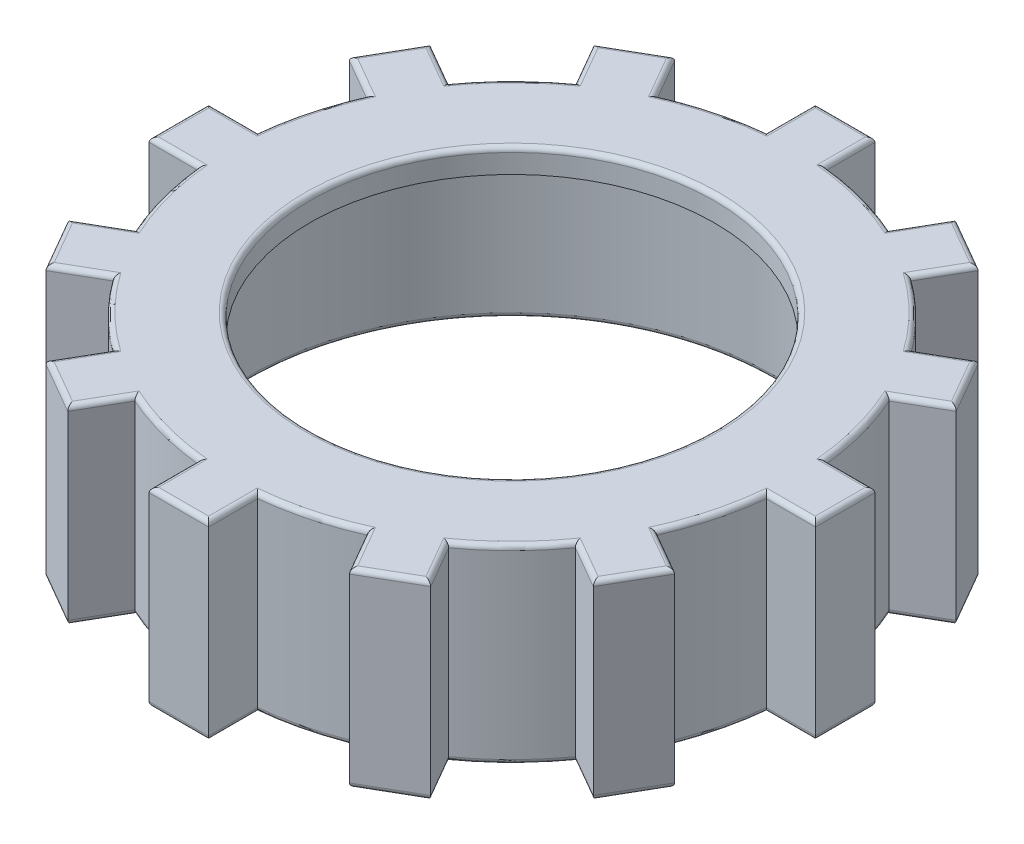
from build123d import *

# Parameters (mm, degrees)
EXTRUSION1_DEPTH             = 8
R_P_TITION_CIRCULAIRE1_COUNT = 12
CONG_1_R                     = 0.2


with BuildPart() as part:
    # Esquisse1 → R_volution1 (revolve)
    with BuildSketch(Plane.XY, mode=Mode.PRIVATE) as r_volution1_sk:
        Polygon((-8.5, 8), (-12, 8), (-12, 0), (-11, 0), (-11, 7), (-8.5, 7), align=None)
    revolve(r_volution1_sk.sketch.rotate(Axis((0, 0, 0), (0, 1, 0)), 270), axis=Axis((0, 0, 0), (0, 1, 0)))

    # Esquisse2 → Extrusion1 (add)
    with BuildSketch(Plane.XZ):
        with BuildLine():
            Line((-1.25, -11.934718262), (-1.25, -14))
            Line((-1.25, -14), (1.25, -14))
            Line((1.25, -14), (1.25, -11.934718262))
            ThreePointArc((1.25, -11.934718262), (0, -12), (-1.25, -11.934718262))
        make_face()
    extrusion1 = extrude(amount=-EXTRUSION1_DEPTH)

    # R_p_tition circulaire1: Extrusion1 ×12 about axis
    r_p_tition_circulaire1_axis = Axis((0, 0, 0), (0, 1, 0))
    for i in range(1, R_P_TITION_CIRCULAIRE1_COUNT):
        add(extrusion1.rotate(r_p_tition_circulaire1_axis, i * 360 / R_P_TITION_CIRCULAIRE1_COUNT))

    # Cong_1
    cong_1_edges = [part.edges().sort_by_distance(p)[0] for p in [
        (0, 8, 8.5),
        (-3.105828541, 8, -11.591109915),
        (-1.25, 8, -12.967359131),
        (0, 8, -14),
        (1.25, 8, -12.967359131),
        (3.105828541, 8, -11.591109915),
        (5.401147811, 8, -11.855062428),
        (7, 8, -12.124355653),
        (7.56621132, 8, -10.605062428),
        (8.485281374, 8, -8.485281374),
        (10.605062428, 8, -7.56621132),
        (12.124355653, 8, -7),
        (11.855062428, 8, -5.401147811),
        (11.591109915, 8, -3.105828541),
        (12.967359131, 8, -1.25),
        (14, 8, 0),
        (12.967359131, 8, 1.25),
        (11.591109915, 8, 3.105828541),
        (11.855062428, 8, 5.401147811),
        (12.124355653, 8, 7),
        (10.605062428, 8, 7.56621132),
        (8.485281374, 8, 8.485281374),
        (7.56621132, 8, 10.605062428),
        (7, 8, 12.124355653),
        (5.401147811, 8, 11.855062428),
        (3.105828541, 8, 11.591109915),
        (1.25, 8, 12.967359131),
        (0, 8, 14),
        (-1.25, 8, 12.967359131),
        (-3.105828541, 8, 11.591109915),
        (-5.401147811, 8, 11.855062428),
        (-7, 8, 12.124355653),
        (-7.56621132, 8, 10.605062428),
        (-8.485281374, 8, 8.485281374),
        (-10.605062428, 8, 7.56621132),
        (-12.124355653, 8, 7),
        (-11.855062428, 8, 5.401147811),
        (-11.591109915, 8, 3.105828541),
        (-12.967359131, 8, 1.25),
        (-14, 8, 0),
        (-12.967359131, 8, -1.25),
        (-11.591109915, 8, -3.105828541),
        (-11.855062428, 8, -5.401147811),
        (-12.124355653, 8, -7),
        (-10.605062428, 8, -7.56621132),
        (-8.485281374, 8, -8.485281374),
        (-7.56621132, 8, -10.605062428),
        (-7, 8, -12.124355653),
        (-5.401147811, 8, -11.855062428),
        (-3.105828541, 0, -11.591109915),
        (-1.25, 0, -12.967359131),
        (0, 0, -14),
        (1.25, 0, -12.967359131),
        (8.485281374, 0, -8.485281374),
        (3.105828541, 0, -11.591109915),
        (10.605062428, 0, -7.56621132),
        (12.124355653, 0, -7),
        (11.855062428, 0, -5.401147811),
        (11.591109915, 0, -3.105828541),
        (12.967359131, 0, -1.25),
        (14, 0, 0),
        (12.967359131, 0, 1.25),
        (11.591109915, 0, 3.105828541),
        (11.855062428, 0, 5.401147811),
        (12.124355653, 0, 7),
        (10.605062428, 0, 7.56621132),
        (8.485281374, 0, 8.485281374),
        (7.56621132, 0, 10.605062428),
        (7, 0, 12.124355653),
        (5.401147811, 0, 11.855062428),
        (3.105828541, 0, 11.591109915),
        (1.25, 0, 12.967359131),
        (0, 0, 14),
        (-1.25, 0, 12.967359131),
        (-3.105828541, 0, 11.591109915),
        (-5.401147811, 0, 11.855062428),
        (-7, 0, 12.124355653),
        (-7.56621132, 0, 10.605062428),
        (-8.485281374, 0, 8.485281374),
        (-10.605062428, 0, 7.56621132),
        (-12.124355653, 0, 7),
        (-11.855062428, 0, 5.401147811),
        (-11.591109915, 0, 3.105828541),
        (-12.967359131, 0, 1.25),
        (-14, 0, 0),
        (-12.967359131, 0, -1.25),
        (-11.591109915, 0, -3.105828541),
        (-11.855062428, 0, -5.401147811),
        (-12.124355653, 0, -7),
        (-10.605062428, 0, -7.56621132),
        (-8.485281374, 0, -8.485281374),
        (-7.56621132, 0, -10.605062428),
        (-7, 0, -12.124355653),
        (-5.401147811, 0, -11.855062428),
        (7.56621132, 0, -10.605062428),
        (7, 0, -12.124355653),
        (5.401147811, 0, -11.855062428),
        (0, 0, 11),
    ]]
    fillet(cong_1_edges, radius=CONG_1_R)


solid = part.part
